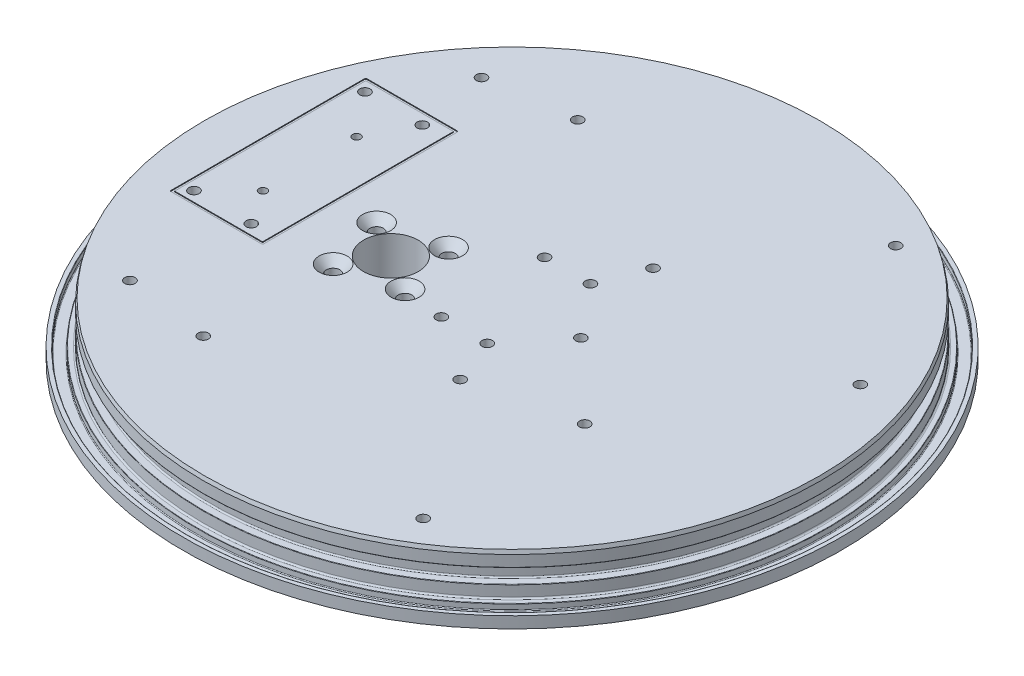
from build123d import *

# Parameters (mm, degrees)
SKETCH19_R                                     = 9.0805
CUT_EXTRUDE4_DEPTH                             = 156.926444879
CSK_FOR_8_FLAT_HEAD_MACHINE_SCREW1_D           = 4.4958
CSK_FOR_8_FLAT_HEAD_MACHINE_SCREW1_CSINK_D     = 9.3159834
CSK_FOR_8_FLAT_HEAD_MACHINE_SCREW1_CSINK_ANGLE = 82
F_8_32_TAPPED_HOLE1_D                          = 3.4544
F_8_32_TAPPED_HOLE1_DEPTH                      = 10.668
F_8_32_TAPPED_HOLE1_TIP                        = 1.037806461
F_6_32_TAPPED_HOLE1_D                          = 2.7051
F_6_32_TAPPED_HOLE1_DEPTH                      = 11.176
F_6_32_TAPPED_HOLE1_TIP                        = 0.81269403
SKETCH45_W                                     = 29.21
SKETCH45_H                                     = 63.5
CUT_EXTRUDE5_DEPTH                             = 0.254


with BuildPart() as part:
    # Sketch1 → Revolve1 (revolve)
    with BuildSketch(Plane.XY, mode=Mode.PRIVATE) as revolve1_sk:
        with BuildLine():
            Line((0, 13.97), (-102.250304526, 13.97))
            Line((-102.250304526, 13.97), (-102.5906, 12.7))
            Line((-102.5906, 12.7), (-102.5906, 9.017))
            ThreePointArc((-102.5906, 9.017), (-102.553402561, 8.927197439), (-102.4636, 8.89))
            Line((-102.4636, 8.89), (-100.2157, 8.89))
            ThreePointArc((-100.2157, 8.89), (-99.901391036, 8.759808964), (-99.7712, 8.4455))
            Line((-99.7712, 8.4455), (-99.7712, 4.5212))
            ThreePointArc((-99.7712, 4.5212), (-99.901391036, 4.206891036), (-100.2157, 4.0767))
            Line((-100.2157, 4.0767), (-102.4636, 4.0767))
            ThreePointArc((-102.4636, 4.0767), (-102.553402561, 4.039502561), (-102.5906, 3.9497))
            Line((-102.5906, 3.9497), (-102.5906, 0.508))
            ThreePointArc((-102.5906, 0.508), (-102.739389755, 0.148789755), (-103.0986, 0))
            Line((-103.0986, 0), (-109.5375, 0))
            Line((-109.5375, 0), (-109.5375, -3.81))
            Line((-109.5375, -3.81), (0, -3.81))
            Line((0, -3.81), (0, 13.97))
        make_face()
    revolve(revolve1_sk.sketch.rotate(Axis((0, 13.97, 0), (0, 1, 0)), 270), axis=Axis((0, 13.97, 0), (0, 1, 0)))

    # Sketch19 → Cut-Extrude4 (cut, through all)
    with BuildSketch(Plane(origin=(0, 13.97, 0), x_dir=(1, 0, 0), z_dir=(0, 1, 0))):
        with Locations(Location((-32.319034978, -7.964508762, 0), (0, 0, 180))):
            Circle(SKETCH19_R)
    extrude(amount=-CUT_EXTRUDE4_DEPTH, mode=Mode.SUBTRACT)

    # Sketch13 → 2-222 O-Ring (revolve, cut)
    with BuildSketch(Plane(origin=(-19.257472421, 0, 4.745695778), x_dir=(0.9709517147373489, 0, -0.23927550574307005), z_dir=(0.23927550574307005, 0, 0.9709517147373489)), mode=Mode.PRIVATE) as f_2_222_o_ring_sk:
        with BuildLine():
            Line((5.394470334, -3.683), (5.394470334, -1.6129))
            ThreePointArc((5.394470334, -1.6129), (5.524661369, -1.298591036), (5.838970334, -1.1684))
            Line((5.838970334, -1.1684), (9.572770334, -1.1684))
            ThreePointArc((9.572770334, -1.1684), (9.887079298, -1.298591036), (10.017270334, -1.6129))
            Line((10.017270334, -1.6129), (10.017270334, -3.683))
            ThreePointArc((10.017270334, -3.683), (10.054467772, -3.772802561), (10.144270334, -3.81))
            Line((10.144270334, -3.81), (5.267470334, -3.81))
            ThreePointArc((5.267470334, -3.81), (5.357272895, -3.772802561), (5.394470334, -3.683))
        make_face()
    revolve(f_2_222_o_ring_sk.sketch.rotate(Axis((-32.319034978, 13.97, 7.964508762), (0, -1, 0)), 193.843784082), axis=Axis((-32.319034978, 13.97, 7.964508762), (0, -1, 0)), mode=Mode.SUBTRACT)

    # CSK for _8 Flat Head Machine Screw1 (through all)
    with Locations(Plane(origin=(0, 13.97, 0), x_dir=(1, 0, 0), z_dir=(0, 1, 0))):
        with Locations((-25.091331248, 3.990456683), (-44.274000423, -0.736805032), (-39.546738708, -19.919474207), (-20.364069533, -15.192212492)):
            CounterSinkHole(CSK_FOR_8_FLAT_HEAD_MACHINE_SCREW1_D / 2, CSK_FOR_8_FLAT_HEAD_MACHINE_SCREW1_CSINK_D / 2, counter_sink_angle=CSK_FOR_8_FLAT_HEAD_MACHINE_SCREW1_CSINK_ANGLE)

    # Sketch39 → 2-172 O-Ring (revolve, cut)
    with BuildSketch(Plane.XY, mode=Mode.PRIVATE) as f_2_172_o_ring_sk:
        with BuildLine():
            Line((-108.2675, 0), (-104.4829, 0))
            ThreePointArc((-104.4829, 0), (-104.572702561, -0.037197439), (-104.6099, -0.127))
            Line((-104.6099, -0.127), (-104.6099, -1.7018))
            ThreePointArc((-104.6099, -1.7018), (-104.684294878, -1.881405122), (-104.8639, -1.9558))
            Line((-104.8639, -1.9558), (-107.8865, -1.9558))
            ThreePointArc((-107.8865, -1.9558), (-108.066105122, -1.881405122), (-108.1405, -1.7018))
            Line((-108.1405, -1.7018), (-108.1405, -0.127))
            ThreePointArc((-108.1405, -0.127), (-108.177697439, -0.037197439), (-108.2675, 0))
        make_face()
    revolve(f_2_172_o_ring_sk.sketch.rotate(Axis((0, -456.133279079, 0), (0, 1, 0)), 270), axis=Axis((0, -456.133279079, 0), (0, 1, 0)), mode=Mode.SUBTRACT)

    # 8-32 Tapped Hole1
    with Locations(Plane(origin=(0, 13.97, 0), x_dir=(1, 0, 0), z_dir=(0, 1, 0))):
        with Locations((-64.77, 34.925), (-83.82, 34.925), (-83.82, -21.9075), (-64.77, -21.9075), (22.86, 0), (-6.35, 17.15135), (-6.35, -17.15135), (8.89, 17.15135), (8.89, -17.15135), (48.641, -78.166866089), (48.269162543, -24.13), (-40.41136936, -62.23), (82.742846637, 33.02), (48.641, 78.86193718), (-40.41136936, 62.23), (14.798375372, -32.052371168), (-68.58, -58.42), (-68.58, 58.42), (14.798375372, 32.052371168)):
            Hole(F_8_32_TAPPED_HOLE1_D / 2, depth=F_8_32_TAPPED_HOLE1_DEPTH)
            with Locations((0, 0, -(F_8_32_TAPPED_HOLE1_DEPTH + F_8_32_TAPPED_HOLE1_TIP / 2))):  # 118° drill point
                Cone(0, F_8_32_TAPPED_HOLE1_D / 2, F_8_32_TAPPED_HOLE1_TIP, mode=Mode.SUBTRACT)

    # 6-32 Tapped Hole1
    with Locations(Plane(origin=(0, 13.97, 0), x_dir=(1, 0, 0), z_dir=(0, 1, 0))):
        with Locations((-72.3025, 20.61875), (-72.3025, -10.49625)):
            Hole(F_6_32_TAPPED_HOLE1_D / 2, depth=F_6_32_TAPPED_HOLE1_DEPTH)
            with Locations((0, 0, -(F_6_32_TAPPED_HOLE1_DEPTH + F_6_32_TAPPED_HOLE1_TIP / 2))):  # 118° drill point
                Cone(0, F_6_32_TAPPED_HOLE1_D / 2, F_6_32_TAPPED_HOLE1_TIP, mode=Mode.SUBTRACT)

    # Sketch45 → Cut-Extrude5 (cut)
    with BuildSketch(Plane(origin=(0, 13.97, 0), x_dir=(1, 0, 0), z_dir=(0, 1, 0))):
        with BuildLine():
            Line((-87.304375, -26.00325), (-57.300625, -26.00325))
            ThreePointArc((-57.300625, -26.00325), (-57.019991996, -25.887008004), (-56.90375, -25.606375))
            Line((-56.90375, -25.606375), (-56.90375, 38.655625))
            ThreePointArc((-56.90375, 38.655625), (-57.019991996, 38.936258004), (-57.300625, 39.0525))
            Line((-57.300625, 39.0525), (-87.304375, 39.0525))
            ThreePointArc((-87.304375, 39.0525), (-87.585008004, 38.936258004), (-87.70125, 38.655625))
            Line((-87.70125, 38.655625), (-87.70125, -25.606375))
            ThreePointArc((-87.70125, -25.606375), (-87.585008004, -25.887008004), (-87.304375, -26.00325))
        make_face()
        with Locations((-72.3025, 6.50875)):
            Rectangle(SKETCH45_W, SKETCH45_H, mode=Mode.SUBTRACT)
    extrude(amount=-CUT_EXTRUDE5_DEPTH, mode=Mode.SUBTRACT)


solid = part.part
